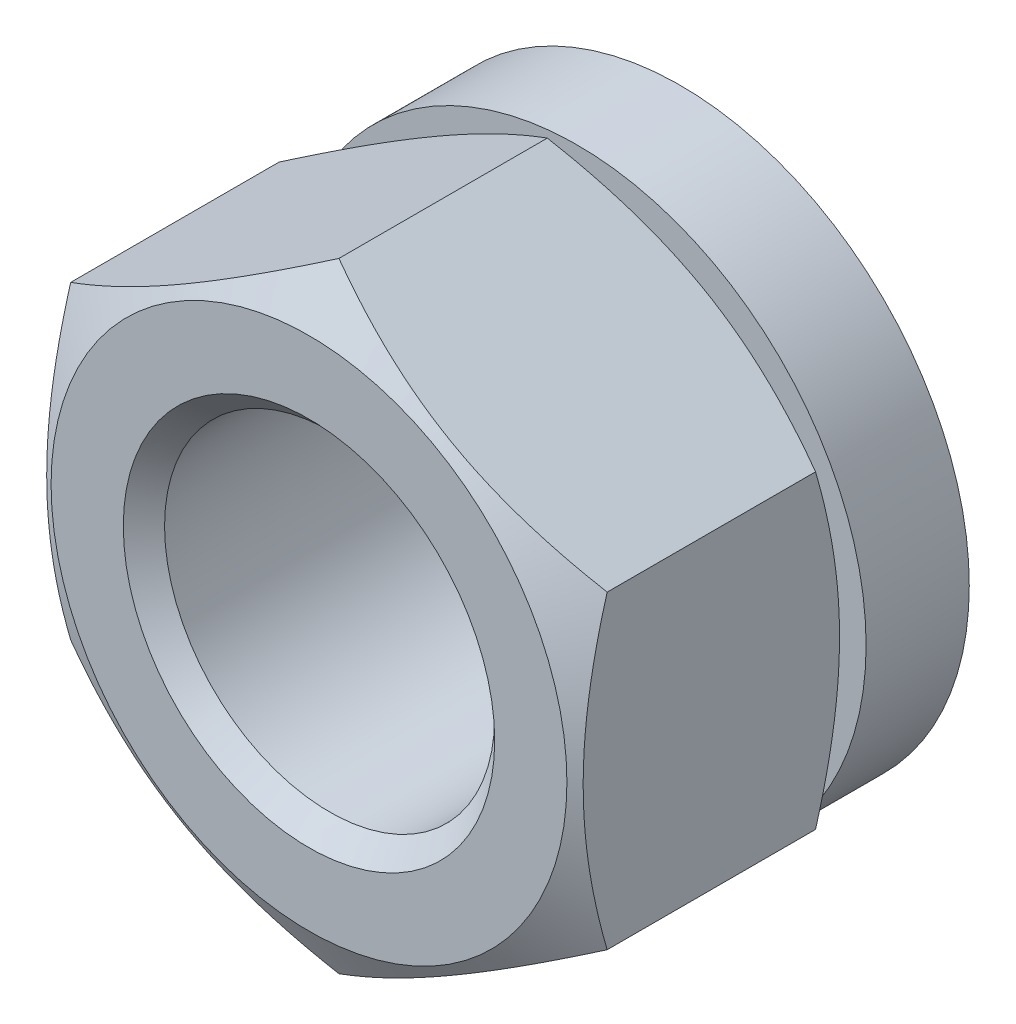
ISO-10303-21;
HEADER;
FILE_DESCRIPTION(('STEP AP214'),'2;1');
FILE_NAME('part.step','',(''),(''),'','','');
FILE_SCHEMA(('AUTOMOTIVE_DESIGN { 1 0 10303 214 1 1 1 1 }'));
ENDSEC;
DATA;
#1=APPLICATION_CONTEXT('core data for automotive mechanical design processes');
#2=APPLICATION_PROTOCOL_DEFINITION('international standard','automotive_design',2000,#1);
#3=PRODUCT_CONTEXT('',#1,'mechanical');
#4=PRODUCT('Part','Part','',(#3));
#5=PRODUCT_RELATED_PRODUCT_CATEGORY('part','',(#4));
#6=PRODUCT_DEFINITION_FORMATION('','',#4);
#7=PRODUCT_DEFINITION_CONTEXT('part definition',#1,'design');
#8=PRODUCT_DEFINITION('design','',#6,#7);
#9=PRODUCT_DEFINITION_SHAPE('','',#8);
#10=(LENGTH_UNIT() NAMED_UNIT(*) SI_UNIT(.MILLI.,.METRE.));
#11=(NAMED_UNIT(*) PLANE_ANGLE_UNIT() SI_UNIT($,.RADIAN.));
#12=(NAMED_UNIT(*) SI_UNIT($,.STERADIAN.) SOLID_ANGLE_UNIT());
#13=UNCERTAINTY_MEASURE_WITH_UNIT(LENGTH_MEASURE(1.E-05),#10,'distance_accuracy_value','');
#14=(GEOMETRIC_REPRESENTATION_CONTEXT(3) GLOBAL_UNCERTAINTY_ASSIGNED_CONTEXT((#13)) GLOBAL_UNIT_ASSIGNED_CONTEXT((#10,
#11,#12)) REPRESENTATION_CONTEXT('',''));
#15=CARTESIAN_POINT('',(0.,0.,0.));
#16=DIRECTION('',(0.,0.,1.));
#17=DIRECTION('',(1.,0.,0.));
#18=AXIS2_PLACEMENT_3D('',#15,#16,#17);
#19=CARTESIAN_POINT('',(0.,0.,0.));
#20=DIRECTION('',(0.,0.,1.));
#21=DIRECTION('',(1.,0.,0.));
#22=AXIS2_PLACEMENT_3D('',#19,#20,#21);
#23=CYLINDRICAL_SURFACE('',#22,4.);
#24=CARTESIAN_POINT('',(0.,0.,8.5));
#25=DIRECTION('',(0.,0.,1.));
#26=DIRECTION('',(1.,0.,0.));
#27=AXIS2_PLACEMENT_3D('',#24,#25,#26);
#28=CIRCLE('',#27,4.);
#29=CARTESIAN_POINT('',(4.,0.,8.5));
#30=VERTEX_POINT('',#29);
#31=EDGE_CURVE('E113',#30,#30,#28,.T.);
#32=ORIENTED_EDGE('',*,*,#31,.T.);
#33=EDGE_LOOP('',(#32));
#34=FACE_BOUND('',#33,.T.);
#35=CARTESIAN_POINT('',(0.,0.,0.));
#36=DIRECTION('',(0.,0.,1.));
#37=DIRECTION('',(1.,0.,0.));
#38=AXIS2_PLACEMENT_3D('',#35,#36,#37);
#39=CIRCLE('',#38,4.);
#40=CARTESIAN_POINT('',(4.,0.,0.));
#41=VERTEX_POINT('',#40);
#42=EDGE_CURVE('E104',#41,#41,#39,.T.);
#43=ORIENTED_EDGE('',*,*,#42,.F.);
#44=EDGE_LOOP('',(#43));
#45=FACE_BOUND('',#44,.T.);
#46=ADVANCED_FACE('F14',(#34,#45),#23,.F.);
#47=CARTESIAN_POINT('',(0.,0.,2.5));
#48=DIRECTION('',(0.,0.,1.));
#49=DIRECTION('',(1.,0.,0.));
#50=AXIS2_PLACEMENT_3D('',#47,#48,#49);
#51=PLANE('',#50);
#52=CARTESIAN_POINT('',(0.,0.,2.5));
#53=DIRECTION('',(0.,0.,1.));
#54=DIRECTION('',(1.,0.,0.));
#55=AXIS2_PLACEMENT_3D('',#52,#53,#54);
#56=CIRCLE('',#55,7.);
#57=CARTESIAN_POINT('',(7.,0.,2.5));
#58=VERTEX_POINT('',#57);
#59=EDGE_CURVE('E110',#58,#58,#56,.T.);
#60=ORIENTED_EDGE('',*,*,#59,.T.);
#61=EDGE_LOOP('',(#60));
#62=FACE_BOUND('',#61,.T.);
#63=CARTESIAN_POINT('',(0.,0.,2.5));
#64=DIRECTION('',(0.,0.,-1.));
#65=DIRECTION('',(-1.,0.,0.));
#66=AXIS2_PLACEMENT_3D('',#63,#64,#65);
#67=CIRCLE('',#66,6.25);
#68=CARTESIAN_POINT('',(-6.25,0.,2.5));
#69=VERTEX_POINT('',#68);
#70=EDGE_CURVE('E85',#69,#69,#67,.T.);
#71=ORIENTED_EDGE('',*,*,#70,.T.);
#72=EDGE_LOOP('',(#71));
#73=FACE_BOUND('',#72,.T.);
#74=ADVANCED_FACE('F241',(#62,#73),#51,.T.);
#75=CARTESIAN_POINT('',(0.,0.,2.5));
#76=DIRECTION('',(0.,0.,-1.));
#77=DIRECTION('',(-1.,0.,0.));
#78=AXIS2_PLACEMENT_3D('',#75,#76,#77);
#79=CYLINDRICAL_SURFACE('',#78,7.);
#80=ORIENTED_EDGE('',*,*,#59,.F.);
#81=EDGE_LOOP('',(#80));
#82=FACE_BOUND('',#81,.T.);
#83=CARTESIAN_POINT('',(0.,0.,0.));
#84=DIRECTION('',(0.,0.,1.));
#85=DIRECTION('',(1.,0.,0.));
#86=AXIS2_PLACEMENT_3D('',#83,#84,#85);
#87=CIRCLE('',#86,7.);
#88=CARTESIAN_POINT('',(7.,0.,0.));
#89=VERTEX_POINT('',#88);
#90=EDGE_CURVE('E107',#89,#89,#87,.T.);
#91=ORIENTED_EDGE('',*,*,#90,.T.);
#92=EDGE_LOOP('',(#91));
#93=FACE_BOUND('',#92,.T.);
#94=ADVANCED_FACE('F246',(#82,#93),#79,.T.);
#95=CARTESIAN_POINT('',(0.,0.,0.));
#96=DIRECTION('',(0.,0.,1.));
#97=DIRECTION('',(1.,0.,0.));
#98=AXIS2_PLACEMENT_3D('',#95,#96,#97);
#99=PLANE('',#98);
#100=ORIENTED_EDGE('',*,*,#42,.T.);
#101=EDGE_LOOP('',(#100));
#102=FACE_BOUND('',#101,.T.);
#103=ORIENTED_EDGE('',*,*,#90,.F.);
#104=EDGE_LOOP('',(#103));
#105=FACE_BOUND('',#104,.T.);
#106=ADVANCED_FACE('F232',(#102,#105),#99,.F.);
#107=CARTESIAN_POINT('',(0.,7.50555349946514,9.));
#108=DIRECTION('',(0.,0.,1.));
#109=DIRECTION('',(1.,0.,0.));
#110=AXIS2_PLACEMENT_3D('',#107,#108,#109);
#111=PLANE('',#110);
#112=CARTESIAN_POINT('',(0.,0.,9.));
#113=DIRECTION('',(0.,0.,-1.));
#114=DIRECTION('',(-1.,0.,0.));
#115=AXIS2_PLACEMENT_3D('',#112,#113,#114);
#116=CIRCLE('',#115,6.25);
#117=CARTESIAN_POINT('',(-6.25,0.,9.));
#118=VERTEX_POINT('',#117);
#119=EDGE_CURVE('E221',#118,#118,#116,.T.);
#120=ORIENTED_EDGE('',*,*,#119,.F.);
#121=EDGE_LOOP('',(#120));
#122=FACE_BOUND('',#121,.T.);
#123=CARTESIAN_POINT('',(0.,0.,9.));
#124=DIRECTION('',(0.,0.,1.));
#125=DIRECTION('',(1.,0.,0.));
#126=AXIS2_PLACEMENT_3D('',#123,#124,#125);
#127=CIRCLE('',#126,4.5);
#128=CARTESIAN_POINT('',(4.5,0.,9.));
#129=VERTEX_POINT('',#128);
#130=EDGE_CURVE('E116',#129,#129,#127,.F.);
#131=ORIENTED_EDGE('',*,*,#130,.T.);
#132=EDGE_LOOP('',(#131));
#133=FACE_BOUND('',#132,.T.);
#134=ADVANCED_FACE('F129',(#122,#133),#111,.T.);
#135=CARTESIAN_POINT('',(6.5,3.75277674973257,9.));
#136=DIRECTION('',(-0.5,-0.866025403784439,0.));
#137=DIRECTION('',(0.866025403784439,-0.5,0.));
#138=AXIS2_PLACEMENT_3D('',#135,#136,#137);
#139=PLANE('',#138);
#140=DIRECTION('',(0.,0.,-1.));
#141=VECTOR('',#140,1.);
#142=CARTESIAN_POINT('',(6.5,3.75277674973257,9.));
#143=LINE('',#142,#141);
#144=CARTESIAN_POINT('',(6.5,3.75277674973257,8.27510584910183));
#145=VERTEX_POINT('',#144);
#146=CARTESIAN_POINT('',(6.5,3.75277674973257,3.22489415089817));
#147=VERTEX_POINT('',#146);
#148=EDGE_CURVE('E88',#145,#147,#143,.T.);
#149=ORIENTED_EDGE('',*,*,#148,.T.);
#150=CARTESIAN_POINT('',(6.5002,3.75266127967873,3.22496081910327));
#151=CARTESIAN_POINT('',(6.35732254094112,3.8351516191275,3.17734199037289));
#152=CARTESIAN_POINT('',(6.21391236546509,3.91794952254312,3.13188426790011));
#153=CARTESIAN_POINT('',(5.92592736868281,4.08421773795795,3.04588624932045));
#154=CARTESIAN_POINT('',(5.78135207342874,4.16768832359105,3.00534807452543));
#155=CARTESIAN_POINT('',(5.34531134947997,4.41943655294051,2.89190856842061));
#156=CARTESIAN_POINT('',(5.05212471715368,4.58870793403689,2.82738537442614));
#157=CARTESIAN_POINT('',(4.61337625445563,4.84201947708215,2.75172415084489));
#158=CARTESIAN_POINT('',(4.46912536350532,4.92530276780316,2.73017042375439));
#159=CARTESIAN_POINT('',(4.17997178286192,5.09224566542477,2.69402788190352));
#160=CARTESIAN_POINT('',(4.03506915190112,5.17590523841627,2.67943845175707));
#161=CARTESIAN_POINT('',(3.74501222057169,5.34336968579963,2.65759631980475));
#162=CARTESIAN_POINT('',(3.5998583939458,5.427174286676,2.65033529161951));
#163=CARTESIAN_POINT('',(3.30942466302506,5.59485627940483,2.64329786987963));
#164=CARTESIAN_POINT('',(3.16414476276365,5.6787336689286,2.64352124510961));
#165=CARTESIAN_POINT('',(2.76612405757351,5.90853103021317,2.65442102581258));
#166=CARTESIAN_POINT('',(2.51351353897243,6.05437578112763,2.67271938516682));
#167=CARTESIAN_POINT('',(2.00997032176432,6.34509659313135,2.73074390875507));
#168=CARTESIAN_POINT('',(1.75903939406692,6.48997163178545,2.77048990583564));
#169=CARTESIAN_POINT('',(1.25448277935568,6.78127752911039,2.86984347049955));
#170=CARTESIAN_POINT('',(1.00092075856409,6.92767163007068,2.92987199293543));
#171=CARTESIAN_POINT('',(0.497578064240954,7.21827667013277,3.06611255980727));
#172=CARTESIAN_POINT('',(0.247790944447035,7.36249133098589,3.142292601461));
#173=CARTESIAN_POINT('',(-0.000199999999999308,7.50566896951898,3.22496081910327));
#174=B_SPLINE_CURVE_WITH_KNOTS('',3,(#150,#151,#152,#153,#154,#155,#156,#157,#158,#159,#160,
#161,#162,#163,#164,#165,#166,#167,#168,#169,#170,#171,#172,#173),.UNSPECIFIED.,.F.,.F.,(4,2,2,
2,2,2,2,2,2,2,2,4),(0.,0.515105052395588,1.03043143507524,2.06322554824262,2.56697389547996,
3.07067772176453,3.57380860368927,4.0769239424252,4.9527935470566,5.82947446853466,
6.72559912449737,7.61996451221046),.UNSPECIFIED.);
#175=CARTESIAN_POINT('',(0.,7.50555349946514,3.22489415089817));
#176=VERTEX_POINT('',#175);
#177=EDGE_CURVE('E35',#147,#176,#174,.T.);
#178=ORIENTED_EDGE('',*,*,#177,.T.);
#179=DIRECTION('',(0.,0.,-1.));
#180=VECTOR('',#179,1.);
#181=CARTESIAN_POINT('',(0.,7.50555349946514,9.));
#182=LINE('',#181,#180);
#183=CARTESIAN_POINT('',(0.,7.50555349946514,8.27510584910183));
#184=VERTEX_POINT('',#183);
#185=EDGE_CURVE('E101',#184,#176,#182,.T.);
#186=ORIENTED_EDGE('',*,*,#185,.F.);
#187=CARTESIAN_POINT('',(-0.000199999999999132,7.50566896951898,8.27503918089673));
#188=CARTESIAN_POINT('',(0.14267745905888,7.4231786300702,8.32265800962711));
#189=CARTESIAN_POINT('',(0.286087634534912,7.34038072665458,8.36811573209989));
#190=CARTESIAN_POINT('',(0.574072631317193,7.17411251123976,8.45411375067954));
#191=CARTESIAN_POINT('',(0.718647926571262,7.09064192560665,8.49465192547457));
#192=CARTESIAN_POINT('',(1.15468865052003,6.83889369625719,8.60809143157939));
#193=CARTESIAN_POINT('',(1.44787528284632,6.66962231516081,8.67261462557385));
#194=CARTESIAN_POINT('',(1.88662374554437,6.41631077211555,8.7482758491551));
#195=CARTESIAN_POINT('',(2.03087463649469,6.33302748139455,8.7698295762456));
#196=CARTESIAN_POINT('',(2.32002821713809,6.16608458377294,8.80597211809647));
#197=CARTESIAN_POINT('',(2.46493084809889,6.08242501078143,8.82056154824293));
#198=CARTESIAN_POINT('',(2.75498777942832,5.91496056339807,8.84240368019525));
#199=CARTESIAN_POINT('',(2.90014160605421,5.8311559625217,8.84966470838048));
#200=CARTESIAN_POINT('',(3.19057533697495,5.66347396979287,8.85670213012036));
#201=CARTESIAN_POINT('',(3.33585523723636,5.57959658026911,8.85647875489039));
#202=CARTESIAN_POINT('',(3.73387594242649,5.34979921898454,8.84557897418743));
#203=CARTESIAN_POINT('',(3.98648646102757,5.20395446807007,8.82728061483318));
#204=CARTESIAN_POINT('',(4.49002967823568,4.91323365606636,8.76925609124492));
#205=CARTESIAN_POINT('',(4.74096060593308,4.76835861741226,8.72951009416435));
#206=CARTESIAN_POINT('',(5.24551722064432,4.47705272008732,8.63015652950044));
#207=CARTESIAN_POINT('',(5.49907924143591,4.33065861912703,8.57012800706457));
#208=CARTESIAN_POINT('',(6.00242193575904,4.04005357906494,8.43388744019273));
#209=CARTESIAN_POINT('',(6.25220905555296,3.89583891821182,8.357707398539));
#210=CARTESIAN_POINT('',(6.5002,3.75266127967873,8.27503918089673));
#211=B_SPLINE_CURVE_WITH_KNOTS('',3,(#187,#188,#189,#190,#191,#192,#193,#194,#195,#196,#197,
#198,#199,#200,#201,#202,#203,#204,#205,#206,#207,#208,#209,#210),.UNSPECIFIED.,.F.,.F.,(4,2,2,
2,2,2,2,2,2,2,2,4),(0.,0.515105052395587,1.03043143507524,2.06322554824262,2.56697389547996,
3.07067772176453,3.57380860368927,4.0769239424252,4.9527935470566,5.82947446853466,
6.72559912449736,7.61996451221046),.UNSPECIFIED.);
#212=EDGE_CURVE('E92',#184,#145,#211,.T.);
#213=ORIENTED_EDGE('',*,*,#212,.T.);
#214=EDGE_LOOP('',(#149,#178,#186,#213));
#215=FACE_BOUND('',#214,.T.);
#216=ADVANCED_FACE('F187',(#215),#139,.F.);
#217=CARTESIAN_POINT('',(0.,7.50555349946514,9.));
#218=DIRECTION('',(0.5,-0.866025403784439,0.));
#219=DIRECTION('',(0.866025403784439,0.5,0.));
#220=AXIS2_PLACEMENT_3D('',#217,#218,#219);
#221=PLANE('',#220);
#222=ORIENTED_EDGE('',*,*,#185,.T.);
#223=CARTESIAN_POINT('',(0.00020000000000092,7.50566896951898,3.22496081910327));
#224=CARTESIAN_POINT('',(-0.142677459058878,7.4231786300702,3.17734199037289));
#225=CARTESIAN_POINT('',(-0.28608763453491,7.34038072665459,3.13188426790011));
#226=CARTESIAN_POINT('',(-0.574072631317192,7.17411251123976,3.04588624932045));
#227=CARTESIAN_POINT('',(-0.718647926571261,7.09064192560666,3.00534807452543));
#228=CARTESIAN_POINT('',(-1.15468865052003,6.83889369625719,2.89190856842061));
#229=CARTESIAN_POINT('',(-1.44787528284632,6.66962231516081,2.82738537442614));
#230=CARTESIAN_POINT('',(-1.88662374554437,6.41631077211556,2.75172415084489));
#231=CARTESIAN_POINT('',(-2.03087463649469,6.33302748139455,2.73017042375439));
#232=CARTESIAN_POINT('',(-2.32002821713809,6.16608458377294,2.69402788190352));
#233=CARTESIAN_POINT('',(-2.46493084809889,6.08242501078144,2.67943845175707));
#234=CARTESIAN_POINT('',(-2.75498777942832,5.91496056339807,2.65759631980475));
#235=CARTESIAN_POINT('',(-2.90014160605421,5.83115596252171,2.65033529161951));
#236=CARTESIAN_POINT('',(-3.19057533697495,5.66347396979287,2.64329786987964));
#237=CARTESIAN_POINT('',(-3.33585523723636,5.57959658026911,2.64352124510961));
#238=CARTESIAN_POINT('',(-3.73387594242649,5.34979921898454,2.65442102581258));
#239=CARTESIAN_POINT('',(-3.98648646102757,5.20395446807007,2.67271938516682));
#240=CARTESIAN_POINT('',(-4.49002967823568,4.91323365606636,2.73074390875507));
#241=CARTESIAN_POINT('',(-4.74096060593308,4.76835861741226,2.77048990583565));
#242=CARTESIAN_POINT('',(-5.24551722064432,4.47705272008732,2.86984347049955));
#243=CARTESIAN_POINT('',(-5.49907924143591,4.33065861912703,2.92987199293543));
#244=CARTESIAN_POINT('',(-6.00242193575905,4.04005357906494,3.06611255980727));
#245=CARTESIAN_POINT('',(-6.25220905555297,3.89583891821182,3.142292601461));
#246=CARTESIAN_POINT('',(-6.5002,3.75266127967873,3.22496081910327));
#247=B_SPLINE_CURVE_WITH_KNOTS('',3,(#223,#224,#225,#226,#227,#228,#229,#230,#231,#232,#233,
#234,#235,#236,#237,#238,#239,#240,#241,#242,#243,#244,#245,#246),.UNSPECIFIED.,.F.,.F.,(4,2,2,
2,2,2,2,2,2,2,2,4),(0.,0.515105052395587,1.03043143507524,2.06322554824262,2.56697389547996,
3.07067772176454,3.57380860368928,4.0769239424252,4.9527935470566,5.82947446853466,
6.72559912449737,7.61996451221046),.UNSPECIFIED.);
#248=CARTESIAN_POINT('',(-6.5,3.75277674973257,3.22489415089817));
#249=VERTEX_POINT('',#248);
#250=EDGE_CURVE('E171',#176,#249,#247,.T.);
#251=ORIENTED_EDGE('',*,*,#250,.T.);
#252=DIRECTION('',(0.,0.,-1.));
#253=VECTOR('',#252,1.);
#254=CARTESIAN_POINT('',(-6.5,3.75277674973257,9.));
#255=LINE('',#254,#253);
#256=CARTESIAN_POINT('',(-6.5,3.75277674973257,8.27510584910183));
#257=VERTEX_POINT('',#256);
#258=EDGE_CURVE('E98',#257,#249,#255,.T.);
#259=ORIENTED_EDGE('',*,*,#258,.F.);
#260=CARTESIAN_POINT('',(-6.5002,3.75266127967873,8.27503918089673));
#261=CARTESIAN_POINT('',(-6.35732254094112,3.83515161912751,8.32265800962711));
#262=CARTESIAN_POINT('',(-6.21391236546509,3.91794952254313,8.36811573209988));
#263=CARTESIAN_POINT('',(-5.92592736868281,4.08421773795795,8.45411375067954));
#264=CARTESIAN_POINT('',(-5.78135207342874,4.16768832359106,8.49465192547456));
#265=CARTESIAN_POINT('',(-5.34531134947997,4.41943655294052,8.60809143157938));
#266=CARTESIAN_POINT('',(-5.05212471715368,4.5887079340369,8.67261462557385));
#267=CARTESIAN_POINT('',(-4.61337625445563,4.84201947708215,8.7482758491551));
#268=CARTESIAN_POINT('',(-4.46912536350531,4.92530276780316,8.7698295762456));
#269=CARTESIAN_POINT('',(-4.17997178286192,5.09224566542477,8.80597211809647));
#270=CARTESIAN_POINT('',(-4.03506915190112,5.17590523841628,8.82056154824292));
#271=CARTESIAN_POINT('',(-3.74501222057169,5.34336968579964,8.84240368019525));
#272=CARTESIAN_POINT('',(-3.5998583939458,5.427174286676,8.84966470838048));
#273=CARTESIAN_POINT('',(-3.30942466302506,5.59485627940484,8.85670213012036));
#274=CARTESIAN_POINT('',(-3.16414476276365,5.6787336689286,8.85647875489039));
#275=CARTESIAN_POINT('',(-2.76612405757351,5.90853103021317,8.84557897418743));
#276=CARTESIAN_POINT('',(-2.51351353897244,6.05437578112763,8.82728061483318));
#277=CARTESIAN_POINT('',(-2.00997032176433,6.34509659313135,8.76925609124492));
#278=CARTESIAN_POINT('',(-1.75903939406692,6.48997163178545,8.72951009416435));
#279=CARTESIAN_POINT('',(-1.25448277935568,6.78127752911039,8.63015652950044));
#280=CARTESIAN_POINT('',(-1.00092075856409,6.92767163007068,8.57012800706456));
#281=CARTESIAN_POINT('',(-0.497578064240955,7.21827667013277,8.43388744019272));
#282=CARTESIAN_POINT('',(-0.247790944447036,7.36249133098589,8.357707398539));
#283=CARTESIAN_POINT('',(0.000200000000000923,7.50566896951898,8.27503918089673));
#284=B_SPLINE_CURVE_WITH_KNOTS('',3,(#260,#261,#262,#263,#264,#265,#266,#267,#268,#269,#270,
#271,#272,#273,#274,#275,#276,#277,#278,#279,#280,#281,#282,#283),.UNSPECIFIED.,.F.,.F.,(4,2,2,
2,2,2,2,2,2,2,2,4),(0.,0.515105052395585,1.03043143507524,2.06322554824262,2.56697389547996,
3.07067772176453,3.57380860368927,4.07692394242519,4.95279354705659,5.82947446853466,
6.72559912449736,7.61996451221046),.UNSPECIFIED.);
#285=EDGE_CURVE('E194',#257,#184,#284,.T.);
#286=ORIENTED_EDGE('',*,*,#285,.T.);
#287=EDGE_LOOP('',(#222,#251,#259,#286));
#288=FACE_BOUND('',#287,.T.);
#289=ADVANCED_FACE('F183',(#288),#221,.F.);
#290=CARTESIAN_POINT('',(-6.5,3.75277674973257,9.));
#291=DIRECTION('',(1.,0.,0.));
#292=DIRECTION('',(0.,0.,-1.));
#293=AXIS2_PLACEMENT_3D('',#290,#291,#292);
#294=PLANE('',#293);
#295=ORIENTED_EDGE('',*,*,#258,.T.);
#296=CARTESIAN_POINT('',(-6.5,-9.98763788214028,5.77155380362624));
#297=CARTESIAN_POINT('',(-6.5,-9.70450167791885,5.63458308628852));
#298=CARTESIAN_POINT('',(-6.5,-9.42070544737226,5.49895285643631));
#299=CARTESIAN_POINT('',(-6.5,-8.85144154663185,5.23112924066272));
#300=CARTESIAN_POINT('',(-6.5,-8.56597361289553,5.09893641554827));
#301=CARTESIAN_POINT('',(-6.5,-7.99149907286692,4.83805842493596));
#302=CARTESIAN_POINT('',(-6.5,-7.7024815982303,4.70939710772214));
#303=CARTESIAN_POINT('',(-6.5,-7.12211516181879,4.45746540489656));
#304=CARTESIAN_POINT('',(-6.5,-6.83076631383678,4.33419475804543));
#305=CARTESIAN_POINT('',(-6.5,-6.23624136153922,4.09077270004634));
#306=CARTESIAN_POINT('',(-6.5,-5.93297746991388,3.97083448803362));
#307=CARTESIAN_POINT('',(-6.5,-5.32286835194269,3.74026218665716));
#308=CARTESIAN_POINT('',(-6.5,-5.01602272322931,3.62962915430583));
#309=CARTESIAN_POINT('',(-6.5,-4.39886321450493,3.42064013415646));
#310=CARTESIAN_POINT('',(-6.5,-4.08855812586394,3.3222584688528));
#311=CARTESIAN_POINT('',(-6.5,-3.46350975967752,3.1409885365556));
#312=CARTESIAN_POINT('',(-6.5,-3.14876794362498,3.05809529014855));
#313=CARTESIAN_POINT('',(-6.5,-2.51633961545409,2.91228145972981));
#314=CARTESIAN_POINT('',(-6.5,-2.19867788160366,2.8492563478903));
#315=CARTESIAN_POINT('',(-6.5,-1.71936795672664,2.7723947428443));
#316=CARTESIAN_POINT('',(-6.5,-1.55911575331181,2.74971913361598));
#317=CARTESIAN_POINT('',(-6.5,-1.23784749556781,2.7107067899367));
#318=CARTESIAN_POINT('',(-6.5,-1.07683151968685,2.69436941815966));
#319=CARTESIAN_POINT('',(-6.5,-0.75631266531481,2.66855901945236));
#320=CARTESIAN_POINT('',(-6.5,-0.596816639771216,2.65900120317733));
#321=CARTESIAN_POINT('',(-6.5,-0.277563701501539,2.6466320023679));
#322=CARTESIAN_POINT('',(-6.5,-0.117806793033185,2.64382050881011));
#323=CARTESIAN_POINT('',(-6.5,0.201683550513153,2.64501084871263));
#324=CARTESIAN_POINT('',(-6.5,0.361416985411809,2.64901273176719));
#325=CARTESIAN_POINT('',(-6.5,0.680576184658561,2.66373372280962));
#326=CARTESIAN_POINT('',(-6.5,0.840001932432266,2.67445318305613));
#327=CARTESIAN_POINT('',(-6.5,1.22600733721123,2.7083163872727));
#328=CARTESIAN_POINT('',(-6.5,1.45229938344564,2.73480578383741));
#329=CARTESIAN_POINT('',(-6.5,1.90313167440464,2.79985156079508));
#330=CARTESIAN_POINT('',(-6.5,2.1276716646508,2.83840966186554));
#331=CARTESIAN_POINT('',(-6.5,2.79844745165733,2.97013615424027));
#332=CARTESIAN_POINT('',(-6.5,3.24157370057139,3.07933044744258));
#333=CARTESIAN_POINT('',(-6.5,3.90404958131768,3.26776873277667));
#334=CARTESIAN_POINT('',(-6.5,4.12685784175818,3.33554508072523));
#335=CARTESIAN_POINT('',(-6.5,4.57030893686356,3.47790895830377));
#336=CARTESIAN_POINT('',(-6.5,4.79095175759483,3.55249653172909));
#337=CARTESIAN_POINT('',(-6.5,5.23014587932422,3.70730521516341));
#338=CARTESIAN_POINT('',(-6.5,5.44869789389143,3.7875243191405));
#339=CARTESIAN_POINT('',(-6.5,5.88400664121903,3.95267506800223));
#340=CARTESIAN_POINT('',(-6.5,6.10076339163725,4.03760666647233));
#341=CARTESIAN_POINT('',(-6.5,6.59789678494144,4.23763520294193));
#342=CARTESIAN_POINT('',(-6.5,6.87772286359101,4.3540976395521));
#343=CARTESIAN_POINT('',(-6.5,7.43511777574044,4.59231812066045));
#344=CARTESIAN_POINT('',(-6.5,7.7126864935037,4.71407643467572));
#345=CARTESIAN_POINT('',(-6.5,8.26596515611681,4.96186248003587));
#346=CARTESIAN_POINT('',(-6.5,8.54167476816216,5.08789095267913));
#347=CARTESIAN_POINT('',(-6.5,9.09149198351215,5.34340011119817));
#348=CARTESIAN_POINT('',(-6.5,9.36559955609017,5.47288086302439));
#349=CARTESIAN_POINT('',(-6.5,10.1863926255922,5.86576184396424));
#350=CARTESIAN_POINT('',(-6.5,10.731058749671,6.13337862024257));
#351=CARTESIAN_POINT('',(-6.5,11.8165352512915,6.67631941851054));
#352=CARTESIAN_POINT('',(-6.5,12.3573454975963,6.95164370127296));
#353=CARTESIAN_POINT('',(-6.5,13.1449891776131,7.35773616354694));
#354=CARTESIAN_POINT('',(-6.5,13.3929507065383,7.48632268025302));
#355=CARTESIAN_POINT('',(-6.5,13.8883360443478,7.74451711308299));
#356=CARTESIAN_POINT('',(-6.5,14.1357598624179,7.87412501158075));
#357=CARTESIAN_POINT('',(-6.5,14.8773503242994,8.26428766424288));
#358=CARTESIAN_POINT('',(-6.5,15.3708175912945,8.52617187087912));
#359=CARTESIAN_POINT('',(-6.5,16.3551847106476,9.05206045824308));
#360=CARTESIAN_POINT('',(-6.5,16.8460878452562,9.31605870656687));
#361=CARTESIAN_POINT('',(-6.5,17.8267034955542,9.84619963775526));
#362=CARTESIAN_POINT('',(-6.5,18.3164160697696,10.1123422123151));
#363=CARTESIAN_POINT('',(-6.5,18.8056860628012,10.3792909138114));
#364=B_SPLINE_CURVE_WITH_KNOTS('',3,(#296,#297,#298,#299,#300,#301,#302,#303,#304,#305,#306,
#307,#308,#309,#310,#311,#312,#313,#314,#315,#316,#317,#318,#319,#320,#321,#322,#323,#324,#325,
#326,#327,#328,#329,#330,#331,#332,#333,#334,#335,#336,#337,#338,#339,#340,#341,#342,#343,#344,
#345,#346,#347,#348,#349,#350,#351,#352,#353,#354,#355,#356,#357,#358,#359,#360,#361,#362,#363),
.UNSPECIFIED.,.F.,.F.,(4,2,2,2,2,2,2,2,2,2,2,2,2,2,2,2,2,2,2,2,2,2,2,2,2,2,2,2,2,2,2,2,2,4),(0.,
0.943592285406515,1.8873375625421,2.83637912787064,3.78537465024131,4.76361581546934,
5.74196795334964,6.71823377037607,7.69418518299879,8.66491286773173,9.15035283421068,
9.63574397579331,10.1149520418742,10.5941523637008,11.0733561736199,11.5525851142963,
12.2357086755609,12.9189296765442,14.2861681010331,14.9847790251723,15.6833944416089,
16.3817622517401,17.0801231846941,17.9893339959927,18.8985911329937,19.8080069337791,
20.7174401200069,22.5379194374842,24.3584604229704,25.1964171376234,26.0343594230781,
27.7103060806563,29.3824634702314,31.0545369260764),.UNSPECIFIED.);
#365=CARTESIAN_POINT('',(-6.5,-3.75277674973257,3.22489415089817));
#366=VERTEX_POINT('',#365);
#367=EDGE_CURVE('E165',#249,#366,#364,.F.);
#368=ORIENTED_EDGE('',*,*,#367,.T.);
#369=DIRECTION('',(0.,0.,-1.));
#370=VECTOR('',#369,1.);
#371=CARTESIAN_POINT('',(-6.5,-3.75277674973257,9.));
#372=LINE('',#371,#370);
#373=CARTESIAN_POINT('',(-6.5,-3.75277674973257,8.27510584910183));
#374=VERTEX_POINT('',#373);
#375=EDGE_CURVE('E90',#374,#366,#372,.T.);
#376=ORIENTED_EDGE('',*,*,#375,.F.);
#377=CARTESIAN_POINT('',(-6.5,-9.98763788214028,5.72844619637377));
#378=CARTESIAN_POINT('',(-6.5,-9.70450167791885,5.86541691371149));
#379=CARTESIAN_POINT('',(-6.5,-9.42070544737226,6.00104714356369));
#380=CARTESIAN_POINT('',(-6.5,-8.85144154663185,6.26887075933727));
#381=CARTESIAN_POINT('',(-6.5,-8.56597361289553,6.40106358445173));
#382=CARTESIAN_POINT('',(-6.5,-7.99149907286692,6.66194157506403));
#383=CARTESIAN_POINT('',(-6.5,-7.70248159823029,6.79060289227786));
#384=CARTESIAN_POINT('',(-6.5,-7.12211516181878,7.04253459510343));
#385=CARTESIAN_POINT('',(-6.5,-6.83076631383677,7.16580524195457));
#386=CARTESIAN_POINT('',(-6.5,-6.23624136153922,7.40922729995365));
#387=CARTESIAN_POINT('',(-6.5,-5.93297746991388,7.52916551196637));
#388=CARTESIAN_POINT('',(-6.5,-5.32286835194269,7.75973781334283));
#389=CARTESIAN_POINT('',(-6.5,-5.01602272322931,7.87037084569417));
#390=CARTESIAN_POINT('',(-6.5,-4.39886321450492,8.07935986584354));
#391=CARTESIAN_POINT('',(-6.5,-4.08855812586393,8.17774153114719));
#392=CARTESIAN_POINT('',(-6.5,-3.46350975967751,8.35901146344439));
#393=CARTESIAN_POINT('',(-6.5,-3.14876794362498,8.44190470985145));
#394=CARTESIAN_POINT('',(-6.5,-2.51633961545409,8.58771854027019));
#395=CARTESIAN_POINT('',(-6.5,-2.19867788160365,8.65074365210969));
#396=CARTESIAN_POINT('',(-6.5,-1.71936795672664,8.72760525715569));
#397=CARTESIAN_POINT('',(-6.5,-1.55911575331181,8.75028086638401));
#398=CARTESIAN_POINT('',(-6.5,-1.23784749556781,8.78929321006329));
#399=CARTESIAN_POINT('',(-6.5,-1.07683151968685,8.80563058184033));
#400=CARTESIAN_POINT('',(-6.5,-0.756312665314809,8.83144098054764));
#401=CARTESIAN_POINT('',(-6.5,-0.596816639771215,8.84099879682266));
#402=CARTESIAN_POINT('',(-6.5,-0.277563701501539,8.85336799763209));
#403=CARTESIAN_POINT('',(-6.5,-0.117806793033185,8.85617949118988));
#404=CARTESIAN_POINT('',(-6.5,0.201683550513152,8.85498915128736));
#405=CARTESIAN_POINT('',(-6.5,0.361416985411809,8.8509872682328));
#406=CARTESIAN_POINT('',(-6.5,0.680576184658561,8.83626627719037));
#407=CARTESIAN_POINT('',(-6.5,0.840001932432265,8.82554681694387));
#408=CARTESIAN_POINT('',(-6.5,1.22600733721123,8.7916836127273));
#409=CARTESIAN_POINT('',(-6.5,1.45229938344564,8.76519421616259));
#410=CARTESIAN_POINT('',(-6.5,1.90313167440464,8.70014843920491));
#411=CARTESIAN_POINT('',(-6.5,2.1276716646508,8.66159033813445));
#412=CARTESIAN_POINT('',(-6.5,2.79844745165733,8.52986384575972));
#413=CARTESIAN_POINT('',(-6.5,3.24157370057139,8.42066955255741));
#414=CARTESIAN_POINT('',(-6.5,3.90404958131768,8.23223126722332));
#415=CARTESIAN_POINT('',(-6.5,4.12685784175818,8.16445491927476));
#416=CARTESIAN_POINT('',(-6.5,4.57030893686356,8.02209104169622));
#417=CARTESIAN_POINT('',(-6.5,4.79095175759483,7.9475034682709));
#418=CARTESIAN_POINT('',(-6.5,5.23014587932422,7.79269478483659));
#419=CARTESIAN_POINT('',(-6.5,5.44869789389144,7.71247568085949));
#420=CARTESIAN_POINT('',(-6.5,5.88400664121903,7.54732493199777));
#421=CARTESIAN_POINT('',(-6.5,6.10076339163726,7.46239333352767));
#422=CARTESIAN_POINT('',(-6.5,6.59789678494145,7.26236479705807));
#423=CARTESIAN_POINT('',(-6.5,6.87772286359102,7.14590236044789));
#424=CARTESIAN_POINT('',(-6.5,7.43511777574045,6.90768187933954));
#425=CARTESIAN_POINT('',(-6.5,7.71268649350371,6.78592356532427));
#426=CARTESIAN_POINT('',(-6.5,8.26596515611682,6.53813751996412));
#427=CARTESIAN_POINT('',(-6.5,8.54167476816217,6.41210904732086));
#428=CARTESIAN_POINT('',(-6.5,9.09149198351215,6.15659988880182));
#429=CARTESIAN_POINT('',(-6.5,9.36559955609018,6.0271191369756));
#430=CARTESIAN_POINT('',(-6.5,10.1863926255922,5.63423815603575));
#431=CARTESIAN_POINT('',(-6.5,10.731058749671,5.36662137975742));
#432=CARTESIAN_POINT('',(-6.5,11.8165352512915,4.82368058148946));
#433=CARTESIAN_POINT('',(-6.5,12.3573454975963,4.54835629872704));
#434=CARTESIAN_POINT('',(-6.5,13.1449891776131,4.14226383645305));
#435=CARTESIAN_POINT('',(-6.5,13.3929507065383,4.01367731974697));
#436=CARTESIAN_POINT('',(-6.5,13.8883360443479,3.75548288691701));
#437=CARTESIAN_POINT('',(-6.5,14.135759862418,3.62587498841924));
#438=CARTESIAN_POINT('',(-6.5,14.8773503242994,3.23571233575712));
#439=CARTESIAN_POINT('',(-6.5,15.3708175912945,2.97382812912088));
#440=CARTESIAN_POINT('',(-6.5,16.3551847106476,2.44793954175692));
#441=CARTESIAN_POINT('',(-6.5,16.8460878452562,2.18394129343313));
#442=CARTESIAN_POINT('',(-6.5,17.8267034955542,1.65380036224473));
#443=CARTESIAN_POINT('',(-6.5,18.3164160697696,1.3876577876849));
#444=CARTESIAN_POINT('',(-6.5,18.8056860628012,1.12070908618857));
#445=B_SPLINE_CURVE_WITH_KNOTS('',3,(#377,#378,#379,#380,#381,#382,#383,#384,#385,#386,#387,
#388,#389,#390,#391,#392,#393,#394,#395,#396,#397,#398,#399,#400,#401,#402,#403,#404,#405,#406,
#407,#408,#409,#410,#411,#412,#413,#414,#415,#416,#417,#418,#419,#420,#421,#422,#423,#424,#425,
#426,#427,#428,#429,#430,#431,#432,#433,#434,#435,#436,#437,#438,#439,#440,#441,#442,#443,#444),
.UNSPECIFIED.,.F.,.F.,(4,2,2,2,2,2,2,2,2,2,2,2,2,2,2,2,2,2,2,2,2,2,2,2,2,2,2,2,2,2,2,2,2,4),(0.,
0.943592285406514,1.8873375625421,2.83637912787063,3.78537465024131,4.76361581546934,
5.74196795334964,6.71823377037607,7.69418518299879,8.66491286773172,9.15035283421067,
9.6357439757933,10.1149520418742,10.5941523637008,11.0733561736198,11.5525851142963,
12.2357086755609,12.9189296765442,14.2861681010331,14.9847790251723,15.6833944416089,
16.3817622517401,17.0801231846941,17.9893339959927,18.8985911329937,19.8080069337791,
20.7174401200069,22.5379194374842,24.3584604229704,25.1964171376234,26.0343594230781,
27.7103060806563,29.3824634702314,31.0545369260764),.UNSPECIFIED.);
#446=EDGE_CURVE('E201',#374,#257,#445,.T.);
#447=ORIENTED_EDGE('',*,*,#446,.T.);
#448=EDGE_LOOP('',(#295,#368,#376,#447));
#449=FACE_BOUND('',#448,.T.);
#450=ADVANCED_FACE('F186',(#449),#294,.F.);
#451=CARTESIAN_POINT('',(-6.5,-3.75277674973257,9.));
#452=DIRECTION('',(0.5,0.866025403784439,0.));
#453=DIRECTION('',(-0.866025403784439,0.5,0.));
#454=AXIS2_PLACEMENT_3D('',#451,#452,#453);
#455=PLANE('',#454);
#456=ORIENTED_EDGE('',*,*,#375,.T.);
#457=CARTESIAN_POINT('',(-6.5002,-3.75266127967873,3.22496081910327));
#458=CARTESIAN_POINT('',(-6.35732254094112,-3.8351516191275,3.17734199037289));
#459=CARTESIAN_POINT('',(-6.21391236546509,-3.91794952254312,3.13188426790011));
#460=CARTESIAN_POINT('',(-5.92592736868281,-4.08421773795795,3.04588624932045));
#461=CARTESIAN_POINT('',(-5.78135207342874,-4.16768832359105,3.00534807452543));
#462=CARTESIAN_POINT('',(-5.34531134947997,-4.41943655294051,2.89190856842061));
#463=CARTESIAN_POINT('',(-5.05212471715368,-4.58870793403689,2.82738537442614));
#464=CARTESIAN_POINT('',(-4.61337625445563,-4.84201947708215,2.75172415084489));
#465=CARTESIAN_POINT('',(-4.46912536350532,-4.92530276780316,2.73017042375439));
#466=CARTESIAN_POINT('',(-4.17997178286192,-5.09224566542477,2.69402788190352));
#467=CARTESIAN_POINT('',(-4.03506915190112,-5.17590523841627,2.67943845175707));
#468=CARTESIAN_POINT('',(-3.74501222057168,-5.34336968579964,2.65759631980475));
#469=CARTESIAN_POINT('',(-3.59985839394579,-5.427174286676,2.65033529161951));
#470=CARTESIAN_POINT('',(-3.30942466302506,-5.59485627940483,2.64329786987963));
#471=CARTESIAN_POINT('',(-3.16414476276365,-5.6787336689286,2.64352124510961));
#472=CARTESIAN_POINT('',(-2.76612405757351,-5.90853103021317,2.65442102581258));
#473=CARTESIAN_POINT('',(-2.51351353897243,-6.05437578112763,2.67271938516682));
#474=CARTESIAN_POINT('',(-2.00997032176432,-6.34509659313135,2.73074390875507));
#475=CARTESIAN_POINT('',(-1.75903939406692,-6.48997163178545,2.77048990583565));
#476=CARTESIAN_POINT('',(-1.25448277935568,-6.78127752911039,2.86984347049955));
#477=CARTESIAN_POINT('',(-1.00092075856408,-6.92767163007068,2.92987199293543));
#478=CARTESIAN_POINT('',(-0.497578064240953,-7.21827667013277,3.06611255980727));
#479=CARTESIAN_POINT('',(-0.247790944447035,-7.36249133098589,3.142292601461));
#480=CARTESIAN_POINT('',(0.000200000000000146,-7.50566896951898,3.22496081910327));
#481=B_SPLINE_CURVE_WITH_KNOTS('',3,(#457,#458,#459,#460,#461,#462,#463,#464,#465,#466,#467,
#468,#469,#470,#471,#472,#473,#474,#475,#476,#477,#478,#479,#480),.UNSPECIFIED.,.F.,.F.,(4,2,2,
2,2,2,2,2,2,2,2,4),(0.,0.515105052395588,1.03043143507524,2.06322554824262,2.56697389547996,
3.07067772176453,3.57380860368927,4.0769239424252,4.9527935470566,5.82947446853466,
6.72559912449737,7.61996451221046),.UNSPECIFIED.);
#482=CARTESIAN_POINT('',(0.,-7.50555349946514,3.22489415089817));
#483=VERTEX_POINT('',#482);
#484=EDGE_CURVE('E84',#366,#483,#481,.T.);
#485=ORIENTED_EDGE('',*,*,#484,.T.);
#486=DIRECTION('',(0.,0.,-1.));
#487=VECTOR('',#486,1.);
#488=CARTESIAN_POINT('',(0.,-7.50555349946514,9.));
#489=LINE('',#488,#487);
#490=CARTESIAN_POINT('',(0.,-7.50555349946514,8.27510584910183));
#491=VERTEX_POINT('',#490);
#492=EDGE_CURVE('E83',#491,#483,#489,.T.);
#493=ORIENTED_EDGE('',*,*,#492,.F.);
#494=CARTESIAN_POINT('',(0.000199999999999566,-7.50566896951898,8.27503918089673));
#495=CARTESIAN_POINT('',(-0.14267745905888,-7.4231786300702,8.32265800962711));
#496=CARTESIAN_POINT('',(-0.286087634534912,-7.34038072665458,8.36811573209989));
#497=CARTESIAN_POINT('',(-0.574072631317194,-7.17411251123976,8.45411375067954));
#498=CARTESIAN_POINT('',(-0.718647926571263,-7.09064192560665,8.49465192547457));
#499=CARTESIAN_POINT('',(-1.15468865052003,-6.83889369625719,8.60809143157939));
#500=CARTESIAN_POINT('',(-1.44787528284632,-6.66962231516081,8.67261462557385));
#501=CARTESIAN_POINT('',(-1.88662374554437,-6.41631077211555,8.7482758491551));
#502=CARTESIAN_POINT('',(-2.03087463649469,-6.33302748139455,8.76982957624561));
#503=CARTESIAN_POINT('',(-2.32002821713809,-6.16608458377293,8.80597211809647));
#504=CARTESIAN_POINT('',(-2.46493084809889,-6.08242501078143,8.82056154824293));
#505=CARTESIAN_POINT('',(-2.75498777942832,-5.91496056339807,8.84240368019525));
#506=CARTESIAN_POINT('',(-2.90014160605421,-5.8311559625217,8.84966470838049));
#507=CARTESIAN_POINT('',(-3.19057533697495,-5.66347396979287,8.85670213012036));
#508=CARTESIAN_POINT('',(-3.33585523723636,-5.5795965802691,8.85647875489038));
#509=CARTESIAN_POINT('',(-3.73387594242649,-5.34979921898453,8.84557897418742));
#510=CARTESIAN_POINT('',(-3.98648646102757,-5.20395446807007,8.82728061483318));
#511=CARTESIAN_POINT('',(-4.49002967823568,-4.91323365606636,8.76925609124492));
#512=CARTESIAN_POINT('',(-4.74096060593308,-4.76835861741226,8.72951009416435));
#513=CARTESIAN_POINT('',(-5.24551722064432,-4.47705272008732,8.63015652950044));
#514=CARTESIAN_POINT('',(-5.49907924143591,-4.33065861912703,8.57012800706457));
#515=CARTESIAN_POINT('',(-6.00242193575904,-4.04005357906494,8.43388744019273));
#516=CARTESIAN_POINT('',(-6.25220905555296,-3.89583891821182,8.357707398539));
#517=CARTESIAN_POINT('',(-6.5002,-3.75266127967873,8.27503918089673));
#518=B_SPLINE_CURVE_WITH_KNOTS('',3,(#494,#495,#496,#497,#498,#499,#500,#501,#502,#503,#504,
#505,#506,#507,#508,#509,#510,#511,#512,#513,#514,#515,#516,#517),.UNSPECIFIED.,.F.,.F.,(4,2,2,
2,2,2,2,2,2,2,2,4),(0.,0.515105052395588,1.03043143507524,2.06322554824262,2.56697389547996,
3.07067772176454,3.57380860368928,4.0769239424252,4.9527935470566,5.82947446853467,
6.72559912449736,7.61996451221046),.UNSPECIFIED.);
#519=EDGE_CURVE('E219',#491,#374,#518,.T.);
#520=ORIENTED_EDGE('',*,*,#519,.T.);
#521=EDGE_LOOP('',(#456,#485,#493,#520));
#522=FACE_BOUND('',#521,.T.);
#523=ADVANCED_FACE('F134',(#522),#455,.F.);
#524=CARTESIAN_POINT('',(0.,-7.50555349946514,9.));
#525=DIRECTION('',(-0.5,0.866025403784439,0.));
#526=DIRECTION('',(-0.866025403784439,-0.5,0.));
#527=AXIS2_PLACEMENT_3D('',#524,#525,#526);
#528=PLANE('',#527);
#529=ORIENTED_EDGE('',*,*,#492,.T.);
#530=CARTESIAN_POINT('',(-0.000200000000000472,-7.50566896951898,3.22496081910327));
#531=CARTESIAN_POINT('',(0.142677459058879,-7.4231786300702,3.17734199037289));
#532=CARTESIAN_POINT('',(0.28608763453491,-7.34038072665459,3.13188426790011));
#533=CARTESIAN_POINT('',(0.574072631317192,-7.17411251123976,3.04588624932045));
#534=CARTESIAN_POINT('',(0.718647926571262,-7.09064192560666,3.00534807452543));
#535=CARTESIAN_POINT('',(1.15468865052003,-6.83889369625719,2.89190856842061));
#536=CARTESIAN_POINT('',(1.44787528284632,-6.66962231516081,2.82738537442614));
#537=CARTESIAN_POINT('',(1.88662374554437,-6.41631077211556,2.75172415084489));
#538=CARTESIAN_POINT('',(2.03087463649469,-6.33302748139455,2.73017042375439));
#539=CARTESIAN_POINT('',(2.32002821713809,-6.16608458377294,2.69402788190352));
#540=CARTESIAN_POINT('',(2.46493084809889,-6.08242501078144,2.67943845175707));
#541=CARTESIAN_POINT('',(2.75498777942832,-5.91496056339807,2.65759631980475));
#542=CARTESIAN_POINT('',(2.90014160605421,-5.83115596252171,2.65033529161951));
#543=CARTESIAN_POINT('',(3.19057533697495,-5.66347396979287,2.64329786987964));
#544=CARTESIAN_POINT('',(3.33585523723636,-5.57959658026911,2.64352124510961));
#545=CARTESIAN_POINT('',(3.73387594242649,-5.34979921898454,2.65442102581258));
#546=CARTESIAN_POINT('',(3.98648646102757,-5.20395446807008,2.67271938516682));
#547=CARTESIAN_POINT('',(4.49002967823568,-4.91323365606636,2.73074390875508));
#548=CARTESIAN_POINT('',(4.74096060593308,-4.76835861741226,2.77048990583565));
#549=CARTESIAN_POINT('',(5.24551722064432,-4.47705272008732,2.86984347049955));
#550=CARTESIAN_POINT('',(5.49907924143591,-4.33065861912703,2.92987199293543));
#551=CARTESIAN_POINT('',(6.00242193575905,-4.04005357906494,3.06611255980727));
#552=CARTESIAN_POINT('',(6.25220905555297,-3.89583891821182,3.142292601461));
#553=CARTESIAN_POINT('',(6.5002,-3.75266127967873,3.22496081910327));
#554=B_SPLINE_CURVE_WITH_KNOTS('',3,(#530,#531,#532,#533,#534,#535,#536,#537,#538,#539,#540,
#541,#542,#543,#544,#545,#546,#547,#548,#549,#550,#551,#552,#553),.UNSPECIFIED.,.F.,.F.,(4,2,2,
2,2,2,2,2,2,2,2,4),(0.,0.515105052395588,1.03043143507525,2.06322554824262,2.56697389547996,
3.07067772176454,3.57380860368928,4.0769239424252,4.9527935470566,5.82947446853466,
6.72559912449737,7.61996451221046),.UNSPECIFIED.);
#555=CARTESIAN_POINT('',(6.5,-3.75277674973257,3.22489415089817));
#556=VERTEX_POINT('',#555);
#557=EDGE_CURVE('E71',#483,#556,#554,.T.);
#558=ORIENTED_EDGE('',*,*,#557,.T.);
#559=DIRECTION('',(0.,0.,-1.));
#560=VECTOR('',#559,1.);
#561=CARTESIAN_POINT('',(6.5,-3.75277674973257,9.));
#562=LINE('',#561,#560);
#563=CARTESIAN_POINT('',(6.5,-3.75277674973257,8.27510584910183));
#564=VERTEX_POINT('',#563);
#565=EDGE_CURVE('E81',#564,#556,#562,.T.);
#566=ORIENTED_EDGE('',*,*,#565,.F.);
#567=CARTESIAN_POINT('',(6.5002,-3.75266127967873,8.27503918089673));
#568=CARTESIAN_POINT('',(6.35732254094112,-3.83515161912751,8.32265800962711));
#569=CARTESIAN_POINT('',(6.21391236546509,-3.91794952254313,8.36811573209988));
#570=CARTESIAN_POINT('',(5.92592736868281,-4.08421773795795,8.45411375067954));
#571=CARTESIAN_POINT('',(5.78135207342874,-4.16768832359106,8.49465192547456));
#572=CARTESIAN_POINT('',(5.34531134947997,-4.41943655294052,8.60809143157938));
#573=CARTESIAN_POINT('',(5.05212471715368,-4.5887079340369,8.67261462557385));
#574=CARTESIAN_POINT('',(4.61337625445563,-4.84201947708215,8.7482758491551));
#575=CARTESIAN_POINT('',(4.46912536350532,-4.92530276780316,8.7698295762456));
#576=CARTESIAN_POINT('',(4.17997178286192,-5.09224566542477,8.80597211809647));
#577=CARTESIAN_POINT('',(4.03506915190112,-5.17590523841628,8.82056154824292));
#578=CARTESIAN_POINT('',(3.74501222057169,-5.34336968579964,8.84240368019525));
#579=CARTESIAN_POINT('',(3.5998583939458,-5.427174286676,8.84966470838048));
#580=CARTESIAN_POINT('',(3.30942466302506,-5.59485627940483,8.85670213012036));
#581=CARTESIAN_POINT('',(3.16414476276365,-5.6787336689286,8.85647875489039));
#582=CARTESIAN_POINT('',(2.76612405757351,-5.90853103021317,8.84557897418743));
#583=CARTESIAN_POINT('',(2.51351353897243,-6.05437578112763,8.82728061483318));
#584=CARTESIAN_POINT('',(2.00997032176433,-6.34509659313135,8.76925609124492));
#585=CARTESIAN_POINT('',(1.75903939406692,-6.48997163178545,8.72951009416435));
#586=CARTESIAN_POINT('',(1.25448277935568,-6.78127752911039,8.63015652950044));
#587=CARTESIAN_POINT('',(1.00092075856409,-6.92767163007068,8.57012800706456));
#588=CARTESIAN_POINT('',(0.497578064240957,-7.21827667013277,8.43388744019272));
#589=CARTESIAN_POINT('',(0.247790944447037,-7.36249133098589,8.357707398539));
#590=CARTESIAN_POINT('',(-0.00020000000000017,-7.50566896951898,8.27503918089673));
#591=B_SPLINE_CURVE_WITH_KNOTS('',3,(#567,#568,#569,#570,#571,#572,#573,#574,#575,#576,#577,
#578,#579,#580,#581,#582,#583,#584,#585,#586,#587,#588,#589,#590),.UNSPECIFIED.,.F.,.F.,(4,2,2,
2,2,2,2,2,2,2,2,4),(0.,0.515105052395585,1.03043143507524,2.06322554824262,2.56697389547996,
3.07067772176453,3.57380860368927,4.07692394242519,4.9527935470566,5.82947446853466,
6.72559912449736,7.61996451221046),.UNSPECIFIED.);
#592=EDGE_CURVE('E42',#564,#491,#591,.T.);
#593=ORIENTED_EDGE('',*,*,#592,.T.);
#594=EDGE_LOOP('',(#529,#558,#566,#593));
#595=FACE_BOUND('',#594,.T.);
#596=ADVANCED_FACE('F80',(#595),#528,.F.);
#597=CARTESIAN_POINT('',(6.5,-3.75277674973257,9.));
#598=DIRECTION('',(-1.,0.,0.));
#599=DIRECTION('',(0.,0.,1.));
#600=AXIS2_PLACEMENT_3D('',#597,#598,#599);
#601=PLANE('',#600);
#602=ORIENTED_EDGE('',*,*,#565,.T.);
#603=CARTESIAN_POINT('',(6.5,-9.98763788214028,5.77155380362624));
#604=CARTESIAN_POINT('',(6.5,-9.70450167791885,5.63458308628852));
#605=CARTESIAN_POINT('',(6.5,-9.42070544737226,5.49895285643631));
#606=CARTESIAN_POINT('',(6.5,-8.85144154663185,5.23112924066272));
#607=CARTESIAN_POINT('',(6.5,-8.56597361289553,5.09893641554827));
#608=CARTESIAN_POINT('',(6.5,-7.99149907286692,4.83805842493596));
#609=CARTESIAN_POINT('',(6.5,-7.7024815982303,4.70939710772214));
#610=CARTESIAN_POINT('',(6.5,-7.12211516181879,4.45746540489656));
#611=CARTESIAN_POINT('',(6.5,-6.83076631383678,4.33419475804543));
#612=CARTESIAN_POINT('',(6.5,-6.23624136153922,4.09077270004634));
#613=CARTESIAN_POINT('',(6.5,-5.93297746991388,3.97083448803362));
#614=CARTESIAN_POINT('',(6.5,-5.32286835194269,3.74026218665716));
#615=CARTESIAN_POINT('',(6.5,-5.01602272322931,3.62962915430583));
#616=CARTESIAN_POINT('',(6.5,-4.39886321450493,3.42064013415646));
#617=CARTESIAN_POINT('',(6.5,-4.08855812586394,3.3222584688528));
#618=CARTESIAN_POINT('',(6.5,-3.46350975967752,3.1409885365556));
#619=CARTESIAN_POINT('',(6.5,-3.14876794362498,3.05809529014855));
#620=CARTESIAN_POINT('',(6.5,-2.51633961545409,2.91228145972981));
#621=CARTESIAN_POINT('',(6.5,-2.19867788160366,2.8492563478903));
#622=CARTESIAN_POINT('',(6.5,-1.71936795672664,2.7723947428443));
#623=CARTESIAN_POINT('',(6.5,-1.55911575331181,2.74971913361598));
#624=CARTESIAN_POINT('',(6.5,-1.23784749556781,2.7107067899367));
#625=CARTESIAN_POINT('',(6.5,-1.07683151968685,2.69436941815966));
#626=CARTESIAN_POINT('',(6.5,-0.75631266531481,2.66855901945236));
#627=CARTESIAN_POINT('',(6.5,-0.596816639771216,2.65900120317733));
#628=CARTESIAN_POINT('',(6.5,-0.277563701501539,2.6466320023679));
#629=CARTESIAN_POINT('',(6.5,-0.117806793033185,2.64382050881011));
#630=CARTESIAN_POINT('',(6.5,0.201683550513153,2.64501084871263));
#631=CARTESIAN_POINT('',(6.5,0.361416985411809,2.64901273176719));
#632=CARTESIAN_POINT('',(6.5,0.680576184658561,2.66373372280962));
#633=CARTESIAN_POINT('',(6.5,0.840001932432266,2.67445318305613));
#634=CARTESIAN_POINT('',(6.5,1.22600733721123,2.7083163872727));
#635=CARTESIAN_POINT('',(6.5,1.45229938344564,2.73480578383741));
#636=CARTESIAN_POINT('',(6.5,1.90313167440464,2.79985156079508));
#637=CARTESIAN_POINT('',(6.5,2.1276716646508,2.83840966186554));
#638=CARTESIAN_POINT('',(6.5,2.79844745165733,2.97013615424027));
#639=CARTESIAN_POINT('',(6.5,3.24157370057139,3.07933044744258));
#640=CARTESIAN_POINT('',(6.5,3.90404958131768,3.26776873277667));
#641=CARTESIAN_POINT('',(6.5,4.12685784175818,3.33554508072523));
#642=CARTESIAN_POINT('',(6.5,4.57030893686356,3.47790895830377));
#643=CARTESIAN_POINT('',(6.5,4.79095175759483,3.55249653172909));
#644=CARTESIAN_POINT('',(6.5,5.23014587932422,3.70730521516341));
#645=CARTESIAN_POINT('',(6.5,5.44869789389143,3.7875243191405));
#646=CARTESIAN_POINT('',(6.5,5.88400664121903,3.95267506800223));
#647=CARTESIAN_POINT('',(6.5,6.10076339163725,4.03760666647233));
#648=CARTESIAN_POINT('',(6.5,6.59789678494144,4.23763520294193));
#649=CARTESIAN_POINT('',(6.5,6.87772286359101,4.3540976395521));
#650=CARTESIAN_POINT('',(6.5,7.43511777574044,4.59231812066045));
#651=CARTESIAN_POINT('',(6.5,7.7126864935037,4.71407643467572));
#652=CARTESIAN_POINT('',(6.5,8.26596515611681,4.96186248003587));
#653=CARTESIAN_POINT('',(6.5,8.54167476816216,5.08789095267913));
#654=CARTESIAN_POINT('',(6.5,9.09149198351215,5.34340011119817));
#655=CARTESIAN_POINT('',(6.5,9.36559955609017,5.47288086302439));
#656=CARTESIAN_POINT('',(6.5,10.1863926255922,5.86576184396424));
#657=CARTESIAN_POINT('',(6.5,10.731058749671,6.13337862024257));
#658=CARTESIAN_POINT('',(6.5,11.8165352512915,6.67631941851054));
#659=CARTESIAN_POINT('',(6.5,12.3573454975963,6.95164370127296));
#660=CARTESIAN_POINT('',(6.5,13.1449891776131,7.35773616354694));
#661=CARTESIAN_POINT('',(6.5,13.3929507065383,7.48632268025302));
#662=CARTESIAN_POINT('',(6.5,13.8883360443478,7.74451711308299));
#663=CARTESIAN_POINT('',(6.5,14.1357598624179,7.87412501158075));
#664=CARTESIAN_POINT('',(6.5,14.8773503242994,8.26428766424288));
#665=CARTESIAN_POINT('',(6.5,15.3708175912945,8.52617187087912));
#666=CARTESIAN_POINT('',(6.5,16.3551847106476,9.05206045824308));
#667=CARTESIAN_POINT('',(6.5,16.8460878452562,9.31605870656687));
#668=CARTESIAN_POINT('',(6.5,17.8267034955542,9.84619963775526));
#669=CARTESIAN_POINT('',(6.5,18.3164160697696,10.1123422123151));
#670=CARTESIAN_POINT('',(6.5,18.8056860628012,10.3792909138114));
#671=B_SPLINE_CURVE_WITH_KNOTS('',3,(#603,#604,#605,#606,#607,#608,#609,#610,#611,#612,#613,
#614,#615,#616,#617,#618,#619,#620,#621,#622,#623,#624,#625,#626,#627,#628,#629,#630,#631,#632,
#633,#634,#635,#636,#637,#638,#639,#640,#641,#642,#643,#644,#645,#646,#647,#648,#649,#650,#651,
#652,#653,#654,#655,#656,#657,#658,#659,#660,#661,#662,#663,#664,#665,#666,#667,#668,#669,#670),
.UNSPECIFIED.,.F.,.F.,(4,2,2,2,2,2,2,2,2,2,2,2,2,2,2,2,2,2,2,2,2,2,2,2,2,2,2,2,2,2,2,2,2,4),(0.,
0.943592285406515,1.8873375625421,2.83637912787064,3.78537465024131,4.76361581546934,
5.74196795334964,6.71823377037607,7.69418518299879,8.66491286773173,9.15035283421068,
9.63574397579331,10.1149520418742,10.5941523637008,11.0733561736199,11.5525851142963,
12.2357086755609,12.9189296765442,14.2861681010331,14.9847790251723,15.6833944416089,
16.3817622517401,17.0801231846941,17.9893339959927,18.8985911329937,19.8080069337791,
20.7174401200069,22.5379194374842,24.3584604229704,25.1964171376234,26.0343594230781,
27.7103060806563,29.3824634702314,31.0545369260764),.UNSPECIFIED.);
#672=EDGE_CURVE('E9',#556,#147,#671,.T.);
#673=ORIENTED_EDGE('',*,*,#672,.T.);
#674=ORIENTED_EDGE('',*,*,#148,.F.);
#675=CARTESIAN_POINT('',(6.5,-9.98763788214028,5.72844619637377));
#676=CARTESIAN_POINT('',(6.5,-9.70450167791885,5.86541691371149));
#677=CARTESIAN_POINT('',(6.5,-9.42070544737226,6.00104714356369));
#678=CARTESIAN_POINT('',(6.5,-8.85144154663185,6.26887075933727));
#679=CARTESIAN_POINT('',(6.5,-8.56597361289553,6.40106358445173));
#680=CARTESIAN_POINT('',(6.5,-7.99149907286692,6.66194157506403));
#681=CARTESIAN_POINT('',(6.5,-7.70248159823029,6.79060289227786));
#682=CARTESIAN_POINT('',(6.5,-7.12211516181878,7.04253459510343));
#683=CARTESIAN_POINT('',(6.5,-6.83076631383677,7.16580524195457));
#684=CARTESIAN_POINT('',(6.5,-6.23624136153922,7.40922729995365));
#685=CARTESIAN_POINT('',(6.5,-5.93297746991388,7.52916551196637));
#686=CARTESIAN_POINT('',(6.5,-5.32286835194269,7.75973781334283));
#687=CARTESIAN_POINT('',(6.5,-5.01602272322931,7.87037084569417));
#688=CARTESIAN_POINT('',(6.5,-4.39886321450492,8.07935986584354));
#689=CARTESIAN_POINT('',(6.5,-4.08855812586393,8.17774153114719));
#690=CARTESIAN_POINT('',(6.5,-3.46350975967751,8.35901146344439));
#691=CARTESIAN_POINT('',(6.5,-3.14876794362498,8.44190470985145));
#692=CARTESIAN_POINT('',(6.5,-2.51633961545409,8.58771854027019));
#693=CARTESIAN_POINT('',(6.5,-2.19867788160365,8.65074365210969));
#694=CARTESIAN_POINT('',(6.5,-1.71936795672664,8.72760525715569));
#695=CARTESIAN_POINT('',(6.5,-1.55911575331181,8.75028086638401));
#696=CARTESIAN_POINT('',(6.5,-1.23784749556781,8.78929321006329));
#697=CARTESIAN_POINT('',(6.5,-1.07683151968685,8.80563058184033));
#698=CARTESIAN_POINT('',(6.5,-0.756312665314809,8.83144098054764));
#699=CARTESIAN_POINT('',(6.5,-0.596816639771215,8.84099879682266));
#700=CARTESIAN_POINT('',(6.5,-0.277563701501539,8.85336799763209));
#701=CARTESIAN_POINT('',(6.5,-0.117806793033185,8.85617949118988));
#702=CARTESIAN_POINT('',(6.5,0.201683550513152,8.85498915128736));
#703=CARTESIAN_POINT('',(6.5,0.361416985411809,8.8509872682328));
#704=CARTESIAN_POINT('',(6.5,0.680576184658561,8.83626627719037));
#705=CARTESIAN_POINT('',(6.5,0.840001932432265,8.82554681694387));
#706=CARTESIAN_POINT('',(6.5,1.22600733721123,8.7916836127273));
#707=CARTESIAN_POINT('',(6.5,1.45229938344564,8.76519421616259));
#708=CARTESIAN_POINT('',(6.5,1.90313167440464,8.70014843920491));
#709=CARTESIAN_POINT('',(6.5,2.1276716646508,8.66159033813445));
#710=CARTESIAN_POINT('',(6.5,2.79844745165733,8.52986384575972));
#711=CARTESIAN_POINT('',(6.5,3.24157370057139,8.42066955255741));
#712=CARTESIAN_POINT('',(6.5,3.90404958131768,8.23223126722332));
#713=CARTESIAN_POINT('',(6.5,4.12685784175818,8.16445491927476));
#714=CARTESIAN_POINT('',(6.5,4.57030893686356,8.02209104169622));
#715=CARTESIAN_POINT('',(6.5,4.79095175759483,7.9475034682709));
#716=CARTESIAN_POINT('',(6.5,5.23014587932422,7.79269478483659));
#717=CARTESIAN_POINT('',(6.5,5.44869789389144,7.71247568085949));
#718=CARTESIAN_POINT('',(6.5,5.88400664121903,7.54732493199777));
#719=CARTESIAN_POINT('',(6.5,6.10076339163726,7.46239333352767));
#720=CARTESIAN_POINT('',(6.5,6.59789678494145,7.26236479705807));
#721=CARTESIAN_POINT('',(6.5,6.87772286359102,7.14590236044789));
#722=CARTESIAN_POINT('',(6.5,7.43511777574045,6.90768187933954));
#723=CARTESIAN_POINT('',(6.5,7.71268649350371,6.78592356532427));
#724=CARTESIAN_POINT('',(6.5,8.26596515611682,6.53813751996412));
#725=CARTESIAN_POINT('',(6.5,8.54167476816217,6.41210904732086));
#726=CARTESIAN_POINT('',(6.5,9.09149198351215,6.15659988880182));
#727=CARTESIAN_POINT('',(6.5,9.36559955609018,6.0271191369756));
#728=CARTESIAN_POINT('',(6.5,10.1863926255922,5.63423815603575));
#729=CARTESIAN_POINT('',(6.5,10.731058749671,5.36662137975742));
#730=CARTESIAN_POINT('',(6.5,11.8165352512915,4.82368058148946));
#731=CARTESIAN_POINT('',(6.5,12.3573454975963,4.54835629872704));
#732=CARTESIAN_POINT('',(6.5,13.1449891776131,4.14226383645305));
#733=CARTESIAN_POINT('',(6.5,13.3929507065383,4.01367731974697));
#734=CARTESIAN_POINT('',(6.5,13.8883360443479,3.75548288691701));
#735=CARTESIAN_POINT('',(6.5,14.135759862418,3.62587498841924));
#736=CARTESIAN_POINT('',(6.5,14.8773503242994,3.23571233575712));
#737=CARTESIAN_POINT('',(6.5,15.3708175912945,2.97382812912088));
#738=CARTESIAN_POINT('',(6.5,16.3551847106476,2.44793954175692));
#739=CARTESIAN_POINT('',(6.5,16.8460878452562,2.18394129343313));
#740=CARTESIAN_POINT('',(6.5,17.8267034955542,1.65380036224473));
#741=CARTESIAN_POINT('',(6.5,18.3164160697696,1.3876577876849));
#742=CARTESIAN_POINT('',(6.5,18.8056860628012,1.12070908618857));
#743=B_SPLINE_CURVE_WITH_KNOTS('',3,(#675,#676,#677,#678,#679,#680,#681,#682,#683,#684,#685,
#686,#687,#688,#689,#690,#691,#692,#693,#694,#695,#696,#697,#698,#699,#700,#701,#702,#703,#704,
#705,#706,#707,#708,#709,#710,#711,#712,#713,#714,#715,#716,#717,#718,#719,#720,#721,#722,#723,
#724,#725,#726,#727,#728,#729,#730,#731,#732,#733,#734,#735,#736,#737,#738,#739,#740,#741,#742),
.UNSPECIFIED.,.F.,.F.,(4,2,2,2,2,2,2,2,2,2,2,2,2,2,2,2,2,2,2,2,2,2,2,2,2,2,2,2,2,2,2,2,2,4),(0.,
0.943592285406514,1.8873375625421,2.83637912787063,3.78537465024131,4.76361581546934,
5.74196795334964,6.71823377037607,7.69418518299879,8.66491286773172,9.15035283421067,
9.6357439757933,10.1149520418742,10.5941523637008,11.0733561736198,11.5525851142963,
12.2357086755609,12.9189296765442,14.2861681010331,14.9847790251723,15.6833944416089,
16.3817622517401,17.0801231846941,17.9893339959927,18.8985911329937,19.8080069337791,
20.7174401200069,22.5379194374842,24.3584604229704,25.1964171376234,26.0343594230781,
27.7103060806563,29.3824634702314,31.0545369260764),.UNSPECIFIED.);
#744=EDGE_CURVE('E28',#145,#564,#743,.F.);
#745=ORIENTED_EDGE('',*,*,#744,.T.);
#746=EDGE_LOOP('',(#602,#673,#674,#745));
#747=FACE_BOUND('',#746,.T.);
#748=ADVANCED_FACE('F87',(#747),#601,.F.);
#749=CARTESIAN_POINT('',(0.,0.,8.5));
#750=DIRECTION('',(0.,0.,1.));
#751=DIRECTION('',(1.,0.,0.));
#752=AXIS2_PLACEMENT_3D('',#749,#750,#751);
#753=CONICAL_SURFACE('',#752,4.,0.785398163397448);
#754=ORIENTED_EDGE('',*,*,#130,.F.);
#755=EDGE_LOOP('',(#754));
#756=FACE_BOUND('',#755,.T.);
#757=ORIENTED_EDGE('',*,*,#31,.F.);
#758=EDGE_LOOP('',(#757));
#759=FACE_BOUND('',#758,.T.);
#760=ADVANCED_FACE('F16',(#756,#759),#753,.F.);
#761=CARTESIAN_POINT('',(0.,0.,9.));
#762=DIRECTION('',(0.,0.,-1.));
#763=DIRECTION('',(-1.,0.,0.));
#764=AXIS2_PLACEMENT_3D('',#761,#762,#763);
#765=CONICAL_SURFACE('',#764,6.25,1.0471975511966);
#766=ORIENTED_EDGE('',*,*,#119,.T.);
#767=EDGE_LOOP('',(#766));
#768=FACE_BOUND('',#767,.T.);
#769=ORIENTED_EDGE('',*,*,#285,.F.);
#770=ORIENTED_EDGE('',*,*,#446,.F.);
#771=ORIENTED_EDGE('',*,*,#519,.F.);
#772=ORIENTED_EDGE('',*,*,#592,.F.);
#773=ORIENTED_EDGE('',*,*,#744,.F.);
#774=ORIENTED_EDGE('',*,*,#212,.F.);
#775=EDGE_LOOP('',(#769,#770,#771,#772,#773,#774));
#776=FACE_BOUND('',#775,.T.);
#777=ADVANCED_FACE('F123',(#768,#776),#765,.T.);
#778=CARTESIAN_POINT('',(0.,0.,3.6192574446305));
#779=DIRECTION('',(0.,0.,1.));
#780=DIRECTION('',(1.,0.,0.));
#781=AXIS2_PLACEMENT_3D('',#778,#779,#780);
#782=CONICAL_SURFACE('',#781,8.18861076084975,1.0471975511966);
#783=ORIENTED_EDGE('',*,*,#70,.F.);
#784=EDGE_LOOP('',(#783));
#785=FACE_BOUND('',#784,.T.);
#786=ORIENTED_EDGE('',*,*,#672,.F.);
#787=ORIENTED_EDGE('',*,*,#557,.F.);
#788=ORIENTED_EDGE('',*,*,#484,.F.);
#789=ORIENTED_EDGE('',*,*,#367,.F.);
#790=ORIENTED_EDGE('',*,*,#250,.F.);
#791=ORIENTED_EDGE('',*,*,#177,.F.);
#792=EDGE_LOOP('',(#786,#787,#788,#789,#790,#791));
#793=FACE_BOUND('',#792,.T.);
#794=ADVANCED_FACE('F70',(#785,#793),#782,.T.);
#795=CLOSED_SHELL('',(#46,#74,#94,#106,#134,#216,#289,#450,#523,#596,#748,#760,#777,#794));
#796=MANIFOLD_SOLID_BREP('B1',#795);
#797=ADVANCED_BREP_SHAPE_REPRESENTATION('',(#18,#796),#14);
#798=SHAPE_DEFINITION_REPRESENTATION(#9,#797);
ENDSEC;
END-ISO-10303-21;
